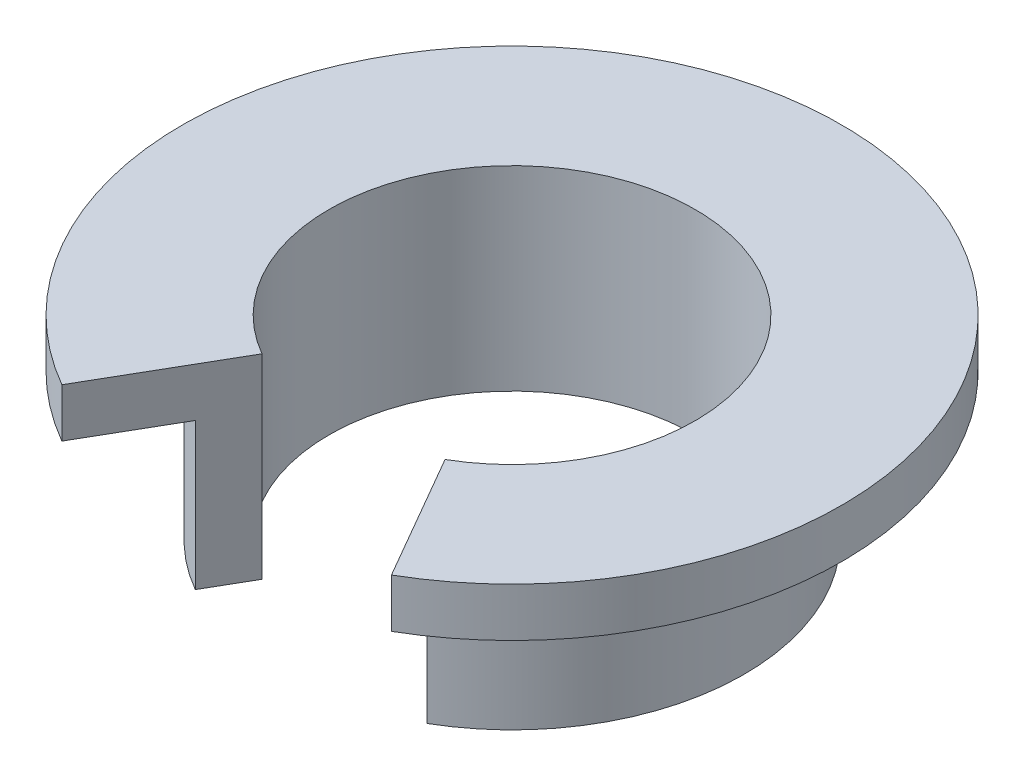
ISO-10303-21;
HEADER;
FILE_DESCRIPTION(('STEP AP214'),'2;1');
FILE_NAME('part.step','',(''),(''),'','','');
FILE_SCHEMA(('AUTOMOTIVE_DESIGN { 1 0 10303 214 1 1 1 1 }'));
ENDSEC;
DATA;
#1=APPLICATION_CONTEXT('core data for automotive mechanical design processes');
#2=APPLICATION_PROTOCOL_DEFINITION('international standard','automotive_design',2000,#1);
#3=PRODUCT_CONTEXT('',#1,'mechanical');
#4=PRODUCT('Part','Part','',(#3));
#5=PRODUCT_RELATED_PRODUCT_CATEGORY('part','',(#4));
#6=PRODUCT_DEFINITION_FORMATION('','',#4);
#7=PRODUCT_DEFINITION_CONTEXT('part definition',#1,'design');
#8=PRODUCT_DEFINITION('design','',#6,#7);
#9=PRODUCT_DEFINITION_SHAPE('','',#8);
#10=(LENGTH_UNIT() NAMED_UNIT(*) SI_UNIT(.MILLI.,.METRE.));
#11=(NAMED_UNIT(*) PLANE_ANGLE_UNIT() SI_UNIT($,.RADIAN.));
#12=(NAMED_UNIT(*) SI_UNIT($,.STERADIAN.) SOLID_ANGLE_UNIT());
#13=UNCERTAINTY_MEASURE_WITH_UNIT(LENGTH_MEASURE(1.E-05),#10,'distance_accuracy_value','');
#14=(GEOMETRIC_REPRESENTATION_CONTEXT(3) GLOBAL_UNCERTAINTY_ASSIGNED_CONTEXT((#13)) GLOBAL_UNIT_ASSIGNED_CONTEXT((#10,
#11,#12)) REPRESENTATION_CONTEXT('',''));
#15=CARTESIAN_POINT('',(0.,0.,0.));
#16=DIRECTION('',(0.,0.,1.));
#17=DIRECTION('',(1.,0.,0.));
#18=AXIS2_PLACEMENT_3D('',#15,#16,#17);
#19=CARTESIAN_POINT('',(9.5,0.,0.));
#20=DIRECTION('',(0.,-1.,0.));
#21=DIRECTION('',(0.,0.,-1.));
#22=AXIS2_PLACEMENT_3D('',#19,#20,#21);
#23=PLANE('',#22);
#24=CARTESIAN_POINT('',(0.,0.,0.));
#25=DIRECTION('',(0.,-1.,0.));
#26=DIRECTION('',(0.,0.,-1.));
#27=AXIS2_PLACEMENT_3D('',#24,#25,#26);
#28=CIRCLE('',#27,9.5);
#29=CARTESIAN_POINT('',(-4.74999999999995,0.,8.2272413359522));
#30=VERTEX_POINT('',#29);
#31=CARTESIAN_POINT('',(4.75000000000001,0.,8.22724133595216));
#32=VERTEX_POINT('',#31);
#33=EDGE_CURVE('E89',#30,#32,#28,.T.);
#34=ORIENTED_EDGE('',*,*,#33,.T.);
#35=DIRECTION('',(-0.500000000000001,0.,-0.866025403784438));
#36=VECTOR('',#35,1.);
#37=CARTESIAN_POINT('',(0.,0.,0.));
#38=LINE('',#37,#36);
#39=CARTESIAN_POINT('',(3.75000000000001,0.,6.49519052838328));
#40=VERTEX_POINT('',#39);
#41=EDGE_CURVE('E46',#32,#40,#38,.T.);
#42=ORIENTED_EDGE('',*,*,#41,.T.);
#43=CARTESIAN_POINT('',(0.,0.,0.));
#44=DIRECTION('',(0.,-1.,0.));
#45=DIRECTION('',(0.,0.,-1.));
#46=AXIS2_PLACEMENT_3D('',#43,#44,#45);
#47=CIRCLE('',#46,7.5);
#48=CARTESIAN_POINT('',(-3.74999999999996,0.,6.49519052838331));
#49=VERTEX_POINT('',#48);
#50=EDGE_CURVE('E95',#49,#40,#47,.T.);
#51=ORIENTED_EDGE('',*,*,#50,.F.);
#52=DIRECTION('',(-0.499999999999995,0.,0.866025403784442));
#53=VECTOR('',#52,1.);
#54=CARTESIAN_POINT('',(-9.09116686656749,0.,15.7463629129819));
#55=LINE('',#54,#53);
#56=EDGE_CURVE('E97',#49,#30,#55,.T.);
#57=ORIENTED_EDGE('',*,*,#56,.T.);
#58=EDGE_LOOP('',(#34,#42,#51,#57));
#59=FACE_BOUND('',#58,.T.);
#60=ADVANCED_FACE('F32',(#59),#23,.T.);
#61=CARTESIAN_POINT('',(0.,0.,0.));
#62=DIRECTION('',(0.,-1.,0.));
#63=DIRECTION('',(0.,0.,-1.));
#64=AXIS2_PLACEMENT_3D('',#61,#62,#63);
#65=CYLINDRICAL_SURFACE('',#64,7.5);
#66=ORIENTED_EDGE('',*,*,#50,.T.);
#67=DIRECTION('',(0.,-1.,0.));
#68=VECTOR('',#67,1.);
#69=CARTESIAN_POINT('',(3.75000000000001,0.,6.49519052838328));
#70=LINE('',#69,#68);
#71=CARTESIAN_POINT('',(3.75000000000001,8.,6.49519052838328));
#72=VERTEX_POINT('',#71);
#73=EDGE_CURVE('E81',#40,#72,#70,.F.);
#74=ORIENTED_EDGE('',*,*,#73,.T.);
#75=CARTESIAN_POINT('',(0.,8.,0.));
#76=DIRECTION('',(0.,-1.,0.));
#77=DIRECTION('',(0.,0.,-1.));
#78=AXIS2_PLACEMENT_3D('',#75,#76,#77);
#79=CIRCLE('',#78,7.5);
#80=CARTESIAN_POINT('',(-3.74999999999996,8.,6.49519052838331));
#81=VERTEX_POINT('',#80);
#82=EDGE_CURVE('E102',#81,#72,#79,.T.);
#83=ORIENTED_EDGE('',*,*,#82,.F.);
#84=DIRECTION('',(0.,-1.,0.));
#85=VECTOR('',#84,1.);
#86=CARTESIAN_POINT('',(-3.74999999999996,0.,6.49519052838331));
#87=LINE('',#86,#85);
#88=EDGE_CURVE('E101',#81,#49,#87,.T.);
#89=ORIENTED_EDGE('',*,*,#88,.T.);
#90=EDGE_LOOP('',(#66,#74,#83,#89));
#91=FACE_BOUND('',#90,.T.);
#92=ADVANCED_FACE('F100',(#91),#65,.F.);
#93=CARTESIAN_POINT('',(7.5,8.,0.));
#94=DIRECTION('',(0.,1.,0.));
#95=DIRECTION('',(0.,0.,1.));
#96=AXIS2_PLACEMENT_3D('',#93,#94,#95);
#97=PLANE('',#96);
#98=ORIENTED_EDGE('',*,*,#82,.T.);
#99=DIRECTION('',(0.500000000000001,0.,0.866025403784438));
#100=VECTOR('',#99,1.);
#101=CARTESIAN_POINT('',(1.87500000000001,8.,3.24759526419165));
#102=LINE('',#101,#100);
#103=CARTESIAN_POINT('',(6.75000000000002,8.,11.6913429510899));
#104=VERTEX_POINT('',#103);
#105=EDGE_CURVE('E84',#72,#104,#102,.T.);
#106=ORIENTED_EDGE('',*,*,#105,.T.);
#107=CARTESIAN_POINT('',(0.,8.,0.));
#108=DIRECTION('',(0.,-1.,0.));
#109=DIRECTION('',(0.,0.,-1.));
#110=AXIS2_PLACEMENT_3D('',#107,#108,#109);
#111=CIRCLE('',#110,13.5);
#112=CARTESIAN_POINT('',(-6.74999999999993,8.,11.69134295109));
#113=VERTEX_POINT('',#112);
#114=EDGE_CURVE('E104',#113,#104,#111,.T.);
#115=ORIENTED_EDGE('',*,*,#114,.F.);
#116=DIRECTION('',(0.499999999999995,0.,-0.866025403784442));
#117=VECTOR('',#116,1.);
#118=CARTESIAN_POINT('',(1.87499999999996,8.,-3.24759526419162));
#119=LINE('',#118,#117);
#120=EDGE_CURVE('E124',#113,#81,#119,.T.);
#121=ORIENTED_EDGE('',*,*,#120,.T.);
#122=EDGE_LOOP('',(#98,#106,#115,#121));
#123=FACE_BOUND('',#122,.T.);
#124=ADVANCED_FACE('F141',(#123),#97,.T.);
#125=CARTESIAN_POINT('',(0.,0.,0.));
#126=DIRECTION('',(0.,-1.,0.));
#127=DIRECTION('',(0.,0.,-1.));
#128=AXIS2_PLACEMENT_3D('',#125,#126,#127);
#129=CYLINDRICAL_SURFACE('',#128,13.5);
#130=ORIENTED_EDGE('',*,*,#114,.T.);
#131=DIRECTION('',(0.,-1.,0.));
#132=VECTOR('',#131,1.);
#133=CARTESIAN_POINT('',(6.75000000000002,0.,11.6913429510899));
#134=LINE('',#133,#132);
#135=CARTESIAN_POINT('',(6.75000000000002,6.,11.6913429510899));
#136=VERTEX_POINT('',#135);
#137=EDGE_CURVE('E117',#104,#136,#134,.T.);
#138=ORIENTED_EDGE('',*,*,#137,.T.);
#139=CARTESIAN_POINT('',(0.,6.,0.));
#140=DIRECTION('',(0.,-1.,0.));
#141=DIRECTION('',(0.,0.,-1.));
#142=AXIS2_PLACEMENT_3D('',#139,#140,#141);
#143=CIRCLE('',#142,13.5);
#144=CARTESIAN_POINT('',(-6.74999999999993,6.,11.69134295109));
#145=VERTEX_POINT('',#144);
#146=EDGE_CURVE('E109',#145,#136,#143,.T.);
#147=ORIENTED_EDGE('',*,*,#146,.F.);
#148=DIRECTION('',(0.,-1.,0.));
#149=VECTOR('',#148,1.);
#150=CARTESIAN_POINT('',(-6.74999999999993,0.,11.69134295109));
#151=LINE('',#150,#149);
#152=EDGE_CURVE('E127',#145,#113,#151,.F.);
#153=ORIENTED_EDGE('',*,*,#152,.T.);
#154=EDGE_LOOP('',(#130,#138,#147,#153));
#155=FACE_BOUND('',#154,.T.);
#156=ADVANCED_FACE('F138',(#155),#129,.T.);
#157=CARTESIAN_POINT('',(13.5,6.,0.));
#158=DIRECTION('',(0.,-1.,0.));
#159=DIRECTION('',(0.,0.,-1.));
#160=AXIS2_PLACEMENT_3D('',#157,#158,#159);
#161=PLANE('',#160);
#162=ORIENTED_EDGE('',*,*,#146,.T.);
#163=DIRECTION('',(-0.500000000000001,0.,-0.866025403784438));
#164=VECTOR('',#163,1.);
#165=CARTESIAN_POINT('',(3.37500000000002,6.,5.84567147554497));
#166=LINE('',#165,#164);
#167=CARTESIAN_POINT('',(4.75000000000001,6.,8.22724133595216));
#168=VERTEX_POINT('',#167);
#169=EDGE_CURVE('E120',#136,#168,#166,.T.);
#170=ORIENTED_EDGE('',*,*,#169,.T.);
#171=CARTESIAN_POINT('',(0.,6.,0.));
#172=DIRECTION('',(0.,-1.,0.));
#173=DIRECTION('',(0.,0.,-1.));
#174=AXIS2_PLACEMENT_3D('',#171,#172,#173);
#175=CIRCLE('',#174,9.5);
#176=CARTESIAN_POINT('',(-4.74999999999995,6.,8.2272413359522));
#177=VERTEX_POINT('',#176);
#178=EDGE_CURVE('E112',#177,#168,#175,.T.);
#179=ORIENTED_EDGE('',*,*,#178,.F.);
#180=DIRECTION('',(-0.499999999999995,0.,0.866025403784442));
#181=VECTOR('',#180,1.);
#182=CARTESIAN_POINT('',(3.37499999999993,6.,-5.84567147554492));
#183=LINE('',#182,#181);
#184=EDGE_CURVE('E53',#177,#145,#183,.T.);
#185=ORIENTED_EDGE('',*,*,#184,.T.);
#186=EDGE_LOOP('',(#162,#170,#179,#185));
#187=FACE_BOUND('',#186,.T.);
#188=ADVANCED_FACE('F135',(#187),#161,.T.);
#189=CARTESIAN_POINT('',(0.,0.,0.));
#190=DIRECTION('',(0.,-1.,0.));
#191=DIRECTION('',(0.,0.,-1.));
#192=AXIS2_PLACEMENT_3D('',#189,#190,#191);
#193=CYLINDRICAL_SURFACE('',#192,9.5);
#194=ORIENTED_EDGE('',*,*,#178,.T.);
#195=DIRECTION('',(0.,-1.,0.));
#196=VECTOR('',#195,1.);
#197=CARTESIAN_POINT('',(4.75000000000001,0.,8.22724133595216));
#198=LINE('',#197,#196);
#199=EDGE_CURVE('E11',#168,#32,#198,.T.);
#200=ORIENTED_EDGE('',*,*,#199,.T.);
#201=ORIENTED_EDGE('',*,*,#33,.F.);
#202=DIRECTION('',(0.,-1.,0.));
#203=VECTOR('',#202,1.);
#204=CARTESIAN_POINT('',(-4.74999999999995,0.,8.2272413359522));
#205=LINE('',#204,#203);
#206=EDGE_CURVE('E39',#30,#177,#205,.F.);
#207=ORIENTED_EDGE('',*,*,#206,.T.);
#208=EDGE_LOOP('',(#194,#200,#201,#207));
#209=FACE_BOUND('',#208,.T.);
#210=ADVANCED_FACE('F132',(#209),#193,.T.);
#211=CARTESIAN_POINT('',(-9.09116686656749,10.,15.7463629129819));
#212=DIRECTION('',(0.866025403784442,0.,0.499999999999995));
#213=DIRECTION('',(0.499999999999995,0.,-0.866025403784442));
#214=AXIS2_PLACEMENT_3D('',#211,#212,#213);
#215=PLANE('',#214);
#216=ORIENTED_EDGE('',*,*,#120,.F.);
#217=ORIENTED_EDGE('',*,*,#152,.F.);
#218=ORIENTED_EDGE('',*,*,#184,.F.);
#219=ORIENTED_EDGE('',*,*,#206,.F.);
#220=ORIENTED_EDGE('',*,*,#56,.F.);
#221=ORIENTED_EDGE('',*,*,#88,.F.);
#222=EDGE_LOOP('',(#216,#217,#218,#219,#220,#221));
#223=FACE_BOUND('',#222,.T.);
#224=ADVANCED_FACE('F142',(#223),#215,.T.);
#225=CARTESIAN_POINT('',(0.,10.,0.));
#226=DIRECTION('',(-0.866025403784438,0.,0.500000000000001));
#227=DIRECTION('',(0.500000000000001,0.,0.866025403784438));
#228=AXIS2_PLACEMENT_3D('',#225,#226,#227);
#229=PLANE('',#228);
#230=ORIENTED_EDGE('',*,*,#41,.F.);
#231=ORIENTED_EDGE('',*,*,#199,.F.);
#232=ORIENTED_EDGE('',*,*,#169,.F.);
#233=ORIENTED_EDGE('',*,*,#137,.F.);
#234=ORIENTED_EDGE('',*,*,#105,.F.);
#235=ORIENTED_EDGE('',*,*,#73,.F.);
#236=EDGE_LOOP('',(#230,#231,#232,#233,#234,#235));
#237=FACE_BOUND('',#236,.T.);
#238=ADVANCED_FACE('F82',(#237),#229,.T.);
#239=CLOSED_SHELL('',(#60,#92,#124,#156,#188,#210,#224,#238));
#240=MANIFOLD_SOLID_BREP('B2',#239);
#241=ADVANCED_BREP_SHAPE_REPRESENTATION('',(#18,#240),#14);
#242=SHAPE_DEFINITION_REPRESENTATION(#9,#241);
ENDSEC;
END-ISO-10303-21;
